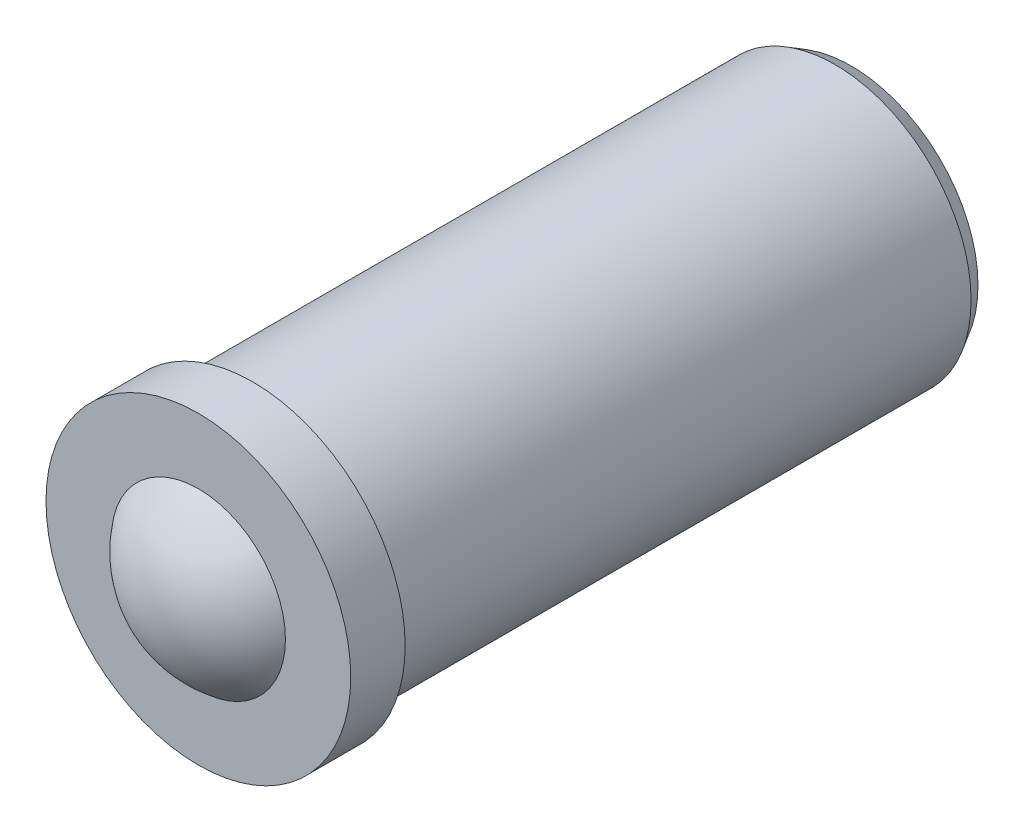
ISO-10303-21;
HEADER;
FILE_DESCRIPTION(('STEP AP214'),'2;1');
FILE_NAME('part.step','',(''),(''),'','','');
FILE_SCHEMA(('AUTOMOTIVE_DESIGN { 1 0 10303 214 1 1 1 1 }'));
ENDSEC;
DATA;
#1=APPLICATION_CONTEXT('core data for automotive mechanical design processes');
#2=APPLICATION_PROTOCOL_DEFINITION('international standard','automotive_design',2000,#1);
#3=PRODUCT_CONTEXT('',#1,'mechanical');
#4=PRODUCT('Part','Part','',(#3));
#5=PRODUCT_RELATED_PRODUCT_CATEGORY('part','',(#4));
#6=PRODUCT_DEFINITION_FORMATION('','',#4);
#7=PRODUCT_DEFINITION_CONTEXT('part definition',#1,'design');
#8=PRODUCT_DEFINITION('design','',#6,#7);
#9=PRODUCT_DEFINITION_SHAPE('','',#8);
#10=(LENGTH_UNIT() NAMED_UNIT(*) SI_UNIT(.MILLI.,.METRE.));
#11=(NAMED_UNIT(*) PLANE_ANGLE_UNIT() SI_UNIT($,.RADIAN.));
#12=(NAMED_UNIT(*) SI_UNIT($,.STERADIAN.) SOLID_ANGLE_UNIT());
#13=UNCERTAINTY_MEASURE_WITH_UNIT(LENGTH_MEASURE(1.E-05),#10,'distance_accuracy_value','');
#14=(GEOMETRIC_REPRESENTATION_CONTEXT(3) GLOBAL_UNCERTAINTY_ASSIGNED_CONTEXT((#13)) GLOBAL_UNIT_ASSIGNED_CONTEXT((#10,
#11,#12)) REPRESENTATION_CONTEXT('',''));
#15=CARTESIAN_POINT('',(0.,0.,0.));
#16=DIRECTION('',(0.,0.,1.));
#17=DIRECTION('',(1.,0.,0.));
#18=AXIS2_PLACEMENT_3D('',#15,#16,#17);
#19=CARTESIAN_POINT('',(0.,0.,1.));
#20=DIRECTION('',(0.,0.,1.));
#21=DIRECTION('',(-1.,0.,0.));
#22=AXIS2_PLACEMENT_3D('',#19,#20,#21);
#23=CYLINDRICAL_SURFACE('',#22,2.5);
#24=CARTESIAN_POINT('',(0.,0.,-10.7));
#25=DIRECTION('',(0.,0.,1.));
#26=DIRECTION('',(1.,0.,0.));
#27=AXIS2_PLACEMENT_3D('',#24,#25,#26);
#28=CIRCLE('',#27,2.5);
#29=CARTESIAN_POINT('',(2.5,0.,-10.7));
#30=VERTEX_POINT('',#29);
#31=EDGE_CURVE('E19',#30,#30,#28,.T.);
#32=ORIENTED_EDGE('',*,*,#31,.T.);
#33=EDGE_LOOP('',(#32));
#34=FACE_BOUND('',#33,.T.);
#35=CARTESIAN_POINT('',(0.,0.,0.));
#36=DIRECTION('',(0.,0.,1.));
#37=DIRECTION('',(-1.,0.,0.));
#38=AXIS2_PLACEMENT_3D('',#35,#36,#37);
#39=CIRCLE('',#38,2.5);
#40=CARTESIAN_POINT('',(-2.5,0.,0.));
#41=VERTEX_POINT('',#40);
#42=EDGE_CURVE('E27',#41,#41,#39,.T.);
#43=ORIENTED_EDGE('',*,*,#42,.F.);
#44=EDGE_LOOP('',(#43));
#45=FACE_BOUND('',#44,.T.);
#46=ADVANCED_FACE('F12',(#34,#45),#23,.T.);
#47=CARTESIAN_POINT('',(-2.5,0.,0.));
#48=DIRECTION('',(0.,0.,1.));
#49=DIRECTION('',(-1.,0.,0.));
#50=AXIS2_PLACEMENT_3D('',#47,#48,#49);
#51=PLANE('',#50);
#52=CARTESIAN_POINT('',(0.,0.,0.));
#53=DIRECTION('',(0.,0.,1.));
#54=DIRECTION('',(-1.,0.,0.));
#55=AXIS2_PLACEMENT_3D('',#52,#53,#54);
#56=CIRCLE('',#55,2.8);
#57=CARTESIAN_POINT('',(-2.8,0.,0.));
#58=VERTEX_POINT('',#57);
#59=EDGE_CURVE('E32',#58,#58,#56,.T.);
#60=ORIENTED_EDGE('',*,*,#59,.F.);
#61=EDGE_LOOP('',(#60));
#62=FACE_BOUND('',#61,.T.);
#63=ORIENTED_EDGE('',*,*,#42,.T.);
#64=EDGE_LOOP('',(#63));
#65=FACE_BOUND('',#64,.T.);
#66=ADVANCED_FACE('F45',(#62,#65),#51,.F.);
#67=CARTESIAN_POINT('',(0.,0.,1.));
#68=DIRECTION('',(0.,0.,1.));
#69=DIRECTION('',(-1.,0.,0.));
#70=AXIS2_PLACEMENT_3D('',#67,#68,#69);
#71=CYLINDRICAL_SURFACE('',#70,2.8);
#72=CARTESIAN_POINT('',(0.,0.,1.));
#73=DIRECTION('',(0.,0.,1.));
#74=DIRECTION('',(-1.,0.,0.));
#75=AXIS2_PLACEMENT_3D('',#72,#73,#74);
#76=CIRCLE('',#75,2.8);
#77=CARTESIAN_POINT('',(-2.8,0.,1.));
#78=VERTEX_POINT('',#77);
#79=EDGE_CURVE('E35',#78,#78,#76,.T.);
#80=ORIENTED_EDGE('',*,*,#79,.F.);
#81=EDGE_LOOP('',(#80));
#82=FACE_BOUND('',#81,.T.);
#83=ORIENTED_EDGE('',*,*,#59,.T.);
#84=EDGE_LOOP('',(#83));
#85=FACE_BOUND('',#84,.T.);
#86=ADVANCED_FACE('F42',(#82,#85),#71,.T.);
#87=CARTESIAN_POINT('',(-2.8,0.,1.));
#88=DIRECTION('',(0.,0.,-1.));
#89=DIRECTION('',(1.,0.,0.));
#90=AXIS2_PLACEMENT_3D('',#87,#88,#89);
#91=PLANE('',#90);
#92=ORIENTED_EDGE('',*,*,#79,.T.);
#93=EDGE_LOOP('',(#92));
#94=FACE_BOUND('',#93,.T.);
#95=CARTESIAN_POINT('',(0.,0.,1.));
#96=DIRECTION('',(0.,0.,1.));
#97=DIRECTION('',(-1.,0.,0.));
#98=AXIS2_PLACEMENT_3D('',#95,#96,#97);
#99=CIRCLE('',#98,1.6);
#100=CARTESIAN_POINT('',(-1.6,0.,1.));
#101=VERTEX_POINT('',#100);
#102=EDGE_CURVE('E23',#101,#101,#99,.F.);
#103=ORIENTED_EDGE('',*,*,#102,.T.);
#104=EDGE_LOOP('',(#103));
#105=FACE_BOUND('',#104,.T.);
#106=ADVANCED_FACE('F39',(#94,#105),#91,.F.);
#107=CARTESIAN_POINT('',(0.,0.,-0.2));
#108=DIRECTION('',(0.,0.,-1.));
#109=DIRECTION('',(-1.,0.,0.));
#110=AXIS2_PLACEMENT_3D('',#107,#108,#109);
#111=SPHERICAL_SURFACE('',#110,2.);
#112=ORIENTED_EDGE('',*,*,#102,.F.);
#113=EDGE_LOOP('',(#112));
#114=FACE_BOUND('',#113,.T.);
#115=ADVANCED_FACE('F61',(#114),#111,.T.);
#116=CARTESIAN_POINT('',(0.,0.,-11.));
#117=DIRECTION('',(0.,0.,1.));
#118=DIRECTION('',(1.,0.,0.));
#119=AXIS2_PLACEMENT_3D('',#116,#117,#118);
#120=PLANE('',#119);
#121=CARTESIAN_POINT('',(0.,0.,-11.));
#122=DIRECTION('',(0.,0.,1.));
#123=DIRECTION('',(1.,0.,0.));
#124=AXIS2_PLACEMENT_3D('',#121,#122,#123);
#125=CIRCLE('',#124,2.32679491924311);
#126=CARTESIAN_POINT('',(2.32679491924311,0.,-11.));
#127=VERTEX_POINT('',#126);
#128=EDGE_CURVE('E8',#127,#127,#125,.F.);
#129=ORIENTED_EDGE('',*,*,#128,.T.);
#130=EDGE_LOOP('',(#129));
#131=FACE_BOUND('',#130,.T.);
#132=ADVANCED_FACE('F64',(#131),#120,.F.);
#133=CARTESIAN_POINT('',(0.,0.,-10.7));
#134=DIRECTION('',(0.,0.,1.));
#135=DIRECTION('',(1.,0.,0.));
#136=AXIS2_PLACEMENT_3D('',#133,#134,#135);
#137=CONICAL_SURFACE('',#136,2.5,0.523598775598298);
#138=ORIENTED_EDGE('',*,*,#128,.F.);
#139=EDGE_LOOP('',(#138));
#140=FACE_BOUND('',#139,.T.);
#141=ORIENTED_EDGE('',*,*,#31,.F.);
#142=EDGE_LOOP('',(#141));
#143=FACE_BOUND('',#142,.T.);
#144=ADVANCED_FACE('F14',(#140,#143),#137,.T.);
#145=CLOSED_SHELL('',(#46,#66,#86,#106,#115,#132,#144));
#146=MANIFOLD_SOLID_BREP('B1',#145);
#147=ADVANCED_BREP_SHAPE_REPRESENTATION('',(#18,#146),#14);
#148=SHAPE_DEFINITION_REPRESENTATION(#9,#147);
ENDSEC;
END-ISO-10303-21;
